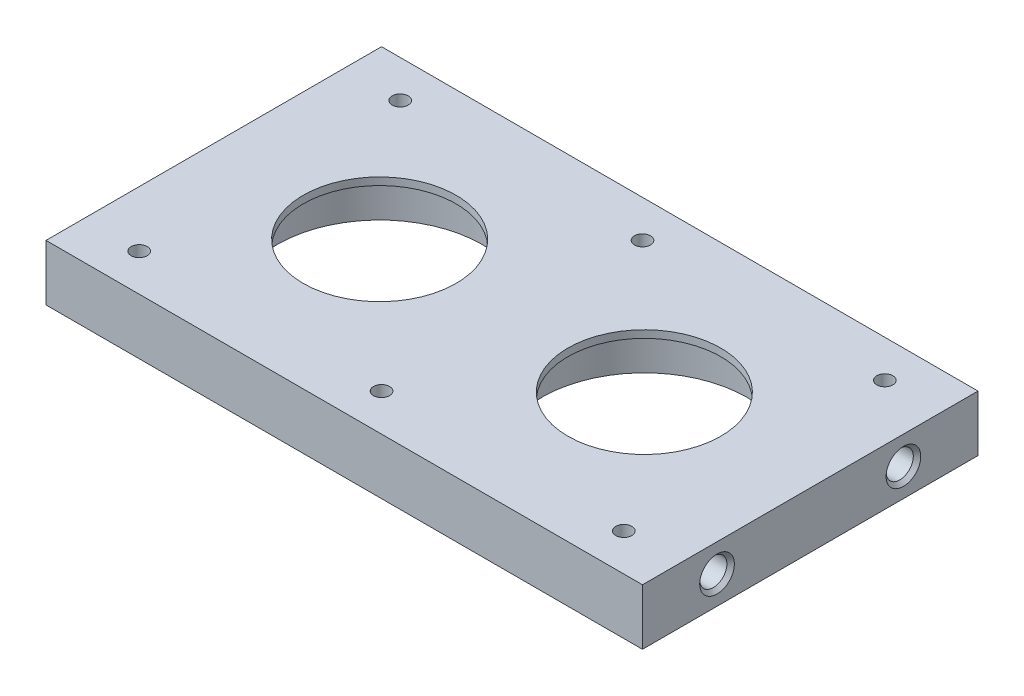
from build123d import *

# Parameters (mm, degrees)
SKETCH1_W           = 160
SKETCH1_H           = 90
SKETCH1_R           = 27.55
BOSS_EXTRUDE1_DEPTH = 13
SKETCH2_W           = 160
SKETCH2_H           = 90
SKETCH2_R           = 20.5
BOSS_EXTRUDE2_DEPTH = 2
SKETCH3_R           = 3.65
CUT_EXTRUDE1_DEPTH  = 20
CUT_EXTRUDE2_START  = -20
SKETCH4_R           = 3.65
CUT_EXTRUDE2_DEPTH  = 20
CHAMFER1_SIZE       = 1
SKETCH5_R           = 2.15
CUT_EXTRUDE3_DEPTH  = 185.187404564


with BuildPart() as part:
    # Sketch1 → Boss-Extrude1 (new body)
    with BuildSketch(Plane(origin=(0, 0, 0), x_dir=(1, 0, 0), z_dir=(0, 1, 0))):
        with Locations((-80, 45)):
            Rectangle(SKETCH1_W, SKETCH1_H)
        with Locations(Location((-115.5, 45, 0), (0, 0, 90))):
            Circle(SKETCH1_R, mode=Mode.SUBTRACT)
        with Locations(Location((-44.5, 45, 0), (0, 0, 90))):
            Circle(SKETCH1_R, mode=Mode.SUBTRACT)
    extrude(amount=BOSS_EXTRUDE1_DEPTH)

    # Sketch2 → Boss-Extrude2 (add)
    with BuildSketch(Plane(origin=(0, 13, 0), x_dir=(1, 0, 0), z_dir=(0, 1, 0))):
        with Locations((-80, 45)):
            Rectangle(SKETCH2_W, SKETCH2_H)
        with Locations(Location((-115.5, 45, 0), (0, 0, 270))):
            Circle(SKETCH2_R, mode=Mode.SUBTRACT)
        with Locations(Location((-44.5, 45, 0), (0, 0, 270))):
            Circle(SKETCH2_R, mode=Mode.SUBTRACT)
    extrude(amount=BOSS_EXTRUDE2_DEPTH)

    # Sketch3 → Cut-Extrude1 (cut)
    with BuildSketch(Plane.ZY.offset(160)):
        with Locations((-70, 7.5)):
            Circle(SKETCH3_R)
        with Locations((-20, 7.5)):
            Circle(SKETCH3_R)
    extrude(amount=-CUT_EXTRUDE1_DEPTH, mode=Mode.SUBTRACT)

    # Sketch4 → Cut-Extrude2 (cut)
    with BuildSketch(Plane(origin=(0, 0, 0), x_dir=(0, 0, -1), z_dir=(1, 0, 0)).offset(CUT_EXTRUDE2_START)):
        with Locations(Location((20, 7.5, 0), (0, 0, 180))):
            Circle(SKETCH4_R)
        with Locations(Location((70, 7.5, 0), (0, 0, 180))):
            Circle(SKETCH4_R)
    extrude(amount=CUT_EXTRUDE2_DEPTH, mode=Mode.SUBTRACT)

    # Chamfer1
    chamfer1_edges = [part.edges().sort_by_distance(p)[0] for p in [
        (-160, 7.5, -73.65),
        (-160, 7.5, -23.65),
        (0, 7.5, -23.65),
        (0, 7.5, -73.65),
    ]]
    chamfer(chamfer1_edges, length=CHAMFER1_SIZE)

    # Sketch5 → Cut-Extrude3 (cut, through all)
    with BuildSketch(Plane.XZ):
        with Locations(Location((-145, -10, 0), (0, 0, 270))):
            Circle(SKETCH5_R)
        with Locations(Location((-80, -10, 0), (0, 0, 270))):
            Circle(SKETCH5_R)
        with Locations(Location((-15, -10, 0), (0, 0, 270))):
            Circle(SKETCH5_R)
        with Locations(Location((-15, -80, 0), (0, 0, 90))):
            Circle(SKETCH5_R)
        with Locations(Location((-80, -80, 0), (0, 0, 90))):
            Circle(SKETCH5_R)
        with Locations(Location((-145, -80, 0), (0, 0, 90))):
            Circle(SKETCH5_R)
    extrude(amount=-CUT_EXTRUDE3_DEPTH, mode=Mode.SUBTRACT)


solid = part.part
